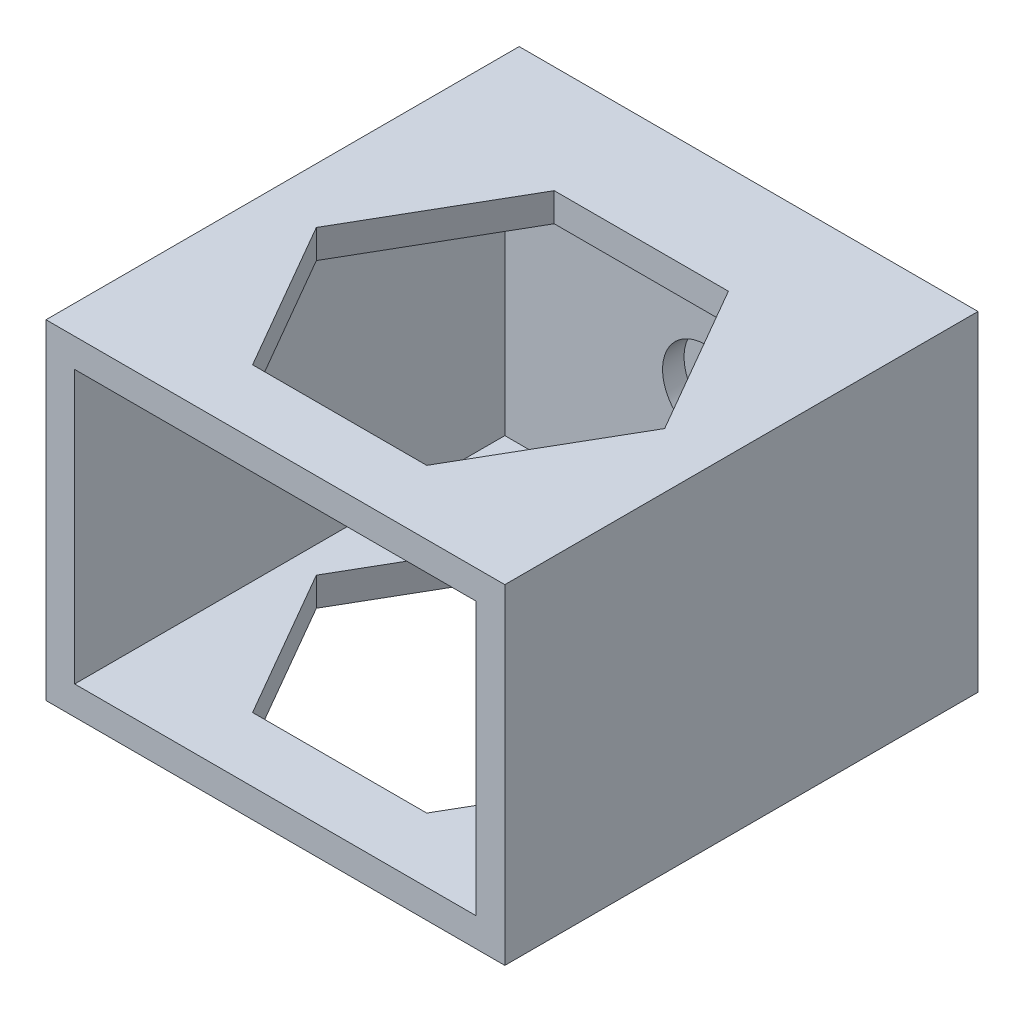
ISO-10303-21;
HEADER;
FILE_DESCRIPTION(('STEP AP214'),'2;1');
FILE_NAME('part.step','',(''),(''),'','','');
FILE_SCHEMA(('AUTOMOTIVE_DESIGN { 1 0 10303 214 1 1 1 1 }'));
ENDSEC;
DATA;
#1=APPLICATION_CONTEXT('core data for automotive mechanical design processes');
#2=APPLICATION_PROTOCOL_DEFINITION('international standard','automotive_design',2000,#1);
#3=PRODUCT_CONTEXT('',#1,'mechanical');
#4=PRODUCT('Part','Part','',(#3));
#5=PRODUCT_RELATED_PRODUCT_CATEGORY('part','',(#4));
#6=PRODUCT_DEFINITION_FORMATION('','',#4);
#7=PRODUCT_DEFINITION_CONTEXT('part definition',#1,'design');
#8=PRODUCT_DEFINITION('design','',#6,#7);
#9=PRODUCT_DEFINITION_SHAPE('','',#8);
#10=(LENGTH_UNIT() NAMED_UNIT(*) SI_UNIT(.MILLI.,.METRE.));
#11=(NAMED_UNIT(*) PLANE_ANGLE_UNIT() SI_UNIT($,.RADIAN.));
#12=(NAMED_UNIT(*) SI_UNIT($,.STERADIAN.) SOLID_ANGLE_UNIT());
#13=UNCERTAINTY_MEASURE_WITH_UNIT(LENGTH_MEASURE(1.E-05),#10,'distance_accuracy_value','');
#14=(GEOMETRIC_REPRESENTATION_CONTEXT(3) GLOBAL_UNCERTAINTY_ASSIGNED_CONTEXT((#13)) GLOBAL_UNIT_ASSIGNED_CONTEXT((#10,
#11,#12)) REPRESENTATION_CONTEXT('',''));
#15=CARTESIAN_POINT('',(0.,0.,0.));
#16=DIRECTION('',(0.,0.,1.));
#17=DIRECTION('',(1.,0.,0.));
#18=AXIS2_PLACEMENT_3D('',#15,#16,#17);
#19=CARTESIAN_POINT('',(-7.91815421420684,6.89860139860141,3.));
#20=DIRECTION('',(0.,0.,-1.));
#21=DIRECTION('',(-1.,0.,0.));
#22=AXIS2_PLACEMENT_3D('',#19,#20,#21);
#23=CYLINDRICAL_SURFACE('',#22,1.5);
#24=CARTESIAN_POINT('',(-7.91815421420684,6.89860139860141,0.));
#25=DIRECTION('',(0.,0.,1.));
#26=DIRECTION('',(1.,0.,0.));
#27=AXIS2_PLACEMENT_3D('',#24,#25,#26);
#28=CIRCLE('',#27,1.5);
#29=CARTESIAN_POINT('',(-6.41815421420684,6.89860139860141,0.));
#30=VERTEX_POINT('',#29);
#31=EDGE_CURVE('E301',#30,#30,#28,.T.);
#32=ORIENTED_EDGE('',*,*,#31,.F.);
#33=EDGE_LOOP('',(#32));
#34=FACE_BOUND('',#33,.T.);
#35=CARTESIAN_POINT('',(-7.91815421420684,6.89860139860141,1.5));
#36=DIRECTION('',(0.,0.,1.));
#37=DIRECTION('',(1.,0.,0.));
#38=AXIS2_PLACEMENT_3D('',#35,#36,#37);
#39=CIRCLE('',#38,1.5);
#40=CARTESIAN_POINT('',(-6.41815421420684,6.89860139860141,1.5));
#41=VERTEX_POINT('',#40);
#42=EDGE_CURVE('E294',#41,#41,#39,.T.);
#43=ORIENTED_EDGE('',*,*,#42,.T.);
#44=EDGE_LOOP('',(#43));
#45=FACE_BOUND('',#44,.T.);
#46=ADVANCED_FACE('F38',(#34,#45),#23,.F.);
#47=CARTESIAN_POINT('',(0.,0.,3.));
#48=DIRECTION('',(0.,0.,1.));
#49=DIRECTION('',(1.,0.,0.));
#50=AXIS2_PLACEMENT_3D('',#47,#48,#49);
#51=PLANE('',#50);
#52=DIRECTION('',(-1.,0.,0.));
#53=VECTOR('',#52,1.);
#54=CARTESIAN_POINT('',(-21.9181542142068,16.3986013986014,3.));
#55=LINE('',#54,#53);
#56=CARTESIAN_POINT('',(6.08184578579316,16.3986013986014,3.));
#57=VERTEX_POINT('',#56);
#58=CARTESIAN_POINT('',(-21.9181542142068,16.3986013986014,3.));
#59=VERTEX_POINT('',#58);
#60=EDGE_CURVE('E253',#57,#59,#55,.T.);
#61=ORIENTED_EDGE('',*,*,#60,.T.);
#62=DIRECTION('',(0.,-1.,0.));
#63=VECTOR('',#62,1.);
#64=CARTESIAN_POINT('',(-21.9181542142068,16.3986013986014,3.));
#65=LINE('',#64,#63);
#66=CARTESIAN_POINT('',(-21.9181542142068,-2.6013986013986,3.));
#67=VERTEX_POINT('',#66);
#68=EDGE_CURVE('E266',#59,#67,#65,.T.);
#69=ORIENTED_EDGE('',*,*,#68,.T.);
#70=DIRECTION('',(1.,0.,0.));
#71=VECTOR('',#70,1.);
#72=CARTESIAN_POINT('',(-21.9181542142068,-2.6013986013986,3.));
#73=LINE('',#72,#71);
#74=CARTESIAN_POINT('',(6.08184578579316,-2.6013986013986,3.));
#75=VERTEX_POINT('',#74);
#76=EDGE_CURVE('E268',#67,#75,#73,.T.);
#77=ORIENTED_EDGE('',*,*,#76,.T.);
#78=DIRECTION('',(0.,1.,0.));
#79=VECTOR('',#78,1.);
#80=CARTESIAN_POINT('',(6.08184578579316,16.3986013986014,3.));
#81=LINE('',#80,#79);
#82=EDGE_CURVE('E257',#75,#57,#81,.T.);
#83=ORIENTED_EDGE('',*,*,#82,.T.);
#84=EDGE_LOOP('',(#61,#69,#77,#83));
#85=FACE_BOUND('',#84,.T.);
#86=CARTESIAN_POINT('',(-7.91815421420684,6.89860139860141,3.));
#87=DIRECTION('',(0.,0.,1.));
#88=DIRECTION('',(1.,0.,0.));
#89=AXIS2_PLACEMENT_3D('',#86,#87,#88);
#90=CIRCLE('',#89,3.);
#91=CARTESIAN_POINT('',(-4.91815421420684,6.89860139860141,3.));
#92=VERTEX_POINT('',#91);
#93=EDGE_CURVE('E297',#92,#92,#90,.T.);
#94=ORIENTED_EDGE('',*,*,#93,.F.);
#95=EDGE_LOOP('',(#94));
#96=FACE_BOUND('',#95,.T.);
#97=ADVANCED_FACE('F364',(#85,#96),#51,.T.);
#98=CARTESIAN_POINT('',(0.,0.,0.));
#99=DIRECTION('',(0.,0.,1.));
#100=DIRECTION('',(1.,0.,0.));
#101=AXIS2_PLACEMENT_3D('',#98,#99,#100);
#102=PLANE('',#101);
#103=DIRECTION('',(0.,-1.,0.));
#104=VECTOR('',#103,1.);
#105=CARTESIAN_POINT('',(-23.9181542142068,18.3986013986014,0.));
#106=LINE('',#105,#104);
#107=CARTESIAN_POINT('',(-23.9181542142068,18.3986013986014,0.));
#108=VERTEX_POINT('',#107);
#109=CARTESIAN_POINT('',(-23.9181542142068,-4.60139860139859,0.));
#110=VERTEX_POINT('',#109);
#111=EDGE_CURVE('E306',#108,#110,#106,.T.);
#112=ORIENTED_EDGE('',*,*,#111,.F.);
#113=DIRECTION('',(-1.,0.,0.));
#114=VECTOR('',#113,1.);
#115=CARTESIAN_POINT('',(-23.9181542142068,18.3986013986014,0.));
#116=LINE('',#115,#114);
#117=CARTESIAN_POINT('',(8.08184578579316,18.3986013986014,0.));
#118=VERTEX_POINT('',#117);
#119=EDGE_CURVE('E313',#118,#108,#116,.T.);
#120=ORIENTED_EDGE('',*,*,#119,.F.);
#121=DIRECTION('',(0.,1.,0.));
#122=VECTOR('',#121,1.);
#123=CARTESIAN_POINT('',(8.08184578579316,18.3986013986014,0.));
#124=LINE('',#123,#122);
#125=CARTESIAN_POINT('',(8.08184578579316,-4.6013986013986,0.));
#126=VERTEX_POINT('',#125);
#127=EDGE_CURVE('E311',#126,#118,#124,.T.);
#128=ORIENTED_EDGE('',*,*,#127,.F.);
#129=DIRECTION('',(1.,0.,0.));
#130=VECTOR('',#129,1.);
#131=CARTESIAN_POINT('',(-23.9181542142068,-4.60139860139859,0.));
#132=LINE('',#131,#130);
#133=EDGE_CURVE('E309',#110,#126,#132,.T.);
#134=ORIENTED_EDGE('',*,*,#133,.F.);
#135=EDGE_LOOP('',(#112,#120,#128,#134));
#136=FACE_BOUND('',#135,.T.);
#137=ORIENTED_EDGE('',*,*,#31,.T.);
#138=EDGE_LOOP('',(#137));
#139=FACE_BOUND('',#138,.T.);
#140=ADVANCED_FACE('F370',(#136,#139),#102,.F.);
#141=CARTESIAN_POINT('',(-23.9181542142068,18.3986013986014,3.));
#142=DIRECTION('',(1.,0.,0.));
#143=DIRECTION('',(0.,0.,-1.));
#144=AXIS2_PLACEMENT_3D('',#141,#142,#143);
#145=PLANE('',#144);
#146=ORIENTED_EDGE('',*,*,#111,.T.);
#147=DIRECTION('',(0.,0.,-1.));
#148=VECTOR('',#147,1.);
#149=CARTESIAN_POINT('',(-23.9181542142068,-4.60139860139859,3.));
#150=LINE('',#149,#148);
#151=CARTESIAN_POINT('',(-23.9181542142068,-4.6013986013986,33.));
#152=VERTEX_POINT('',#151);
#153=EDGE_CURVE('E324',#152,#110,#150,.T.);
#154=ORIENTED_EDGE('',*,*,#153,.F.);
#155=DIRECTION('',(0.,-1.,0.));
#156=VECTOR('',#155,1.);
#157=CARTESIAN_POINT('',(-23.9181542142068,18.3986013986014,33.));
#158=LINE('',#157,#156);
#159=CARTESIAN_POINT('',(-23.9181542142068,18.3986013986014,33.));
#160=VERTEX_POINT('',#159);
#161=EDGE_CURVE('E282',#160,#152,#158,.T.);
#162=ORIENTED_EDGE('',*,*,#161,.F.);
#163=DIRECTION('',(0.,0.,-1.));
#164=VECTOR('',#163,1.);
#165=CARTESIAN_POINT('',(-23.9181542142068,18.3986013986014,3.));
#166=LINE('',#165,#164);
#167=EDGE_CURVE('E315',#160,#108,#166,.T.);
#168=ORIENTED_EDGE('',*,*,#167,.T.);
#169=EDGE_LOOP('',(#146,#154,#162,#168));
#170=FACE_BOUND('',#169,.T.);
#171=ADVANCED_FACE('F40',(#170),#145,.F.);
#172=CARTESIAN_POINT('',(-23.9181542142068,-4.60139860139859,3.));
#173=DIRECTION('',(0.,1.,0.));
#174=DIRECTION('',(-1.,0.,0.));
#175=AXIS2_PLACEMENT_3D('',#172,#173,#174);
#176=PLANE('',#175);
#177=DIRECTION('',(0.500000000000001,0.,-0.866025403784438));
#178=VECTOR('',#177,1.);
#179=CARTESIAN_POINT('',(-20.0646045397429,-4.60139860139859,18.));
#180=LINE('',#179,#178);
#181=CARTESIAN_POINT('',(-20.0646045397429,-4.60139860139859,18.));
#182=VERTEX_POINT('',#181);
#183=CARTESIAN_POINT('',(-13.9913793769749,-4.60139860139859,7.48086545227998));
#184=VERTEX_POINT('',#183);
#185=EDGE_CURVE('E189',#182,#184,#180,.T.);
#186=ORIENTED_EDGE('',*,*,#185,.F.);
#187=DIRECTION('',(-0.499999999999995,0.,-0.866025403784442));
#188=VECTOR('',#187,1.);
#189=CARTESIAN_POINT('',(-13.991379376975,-4.60139860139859,28.5191345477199));
#190=LINE('',#189,#188);
#191=CARTESIAN_POINT('',(-13.991379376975,-4.60139860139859,28.5191345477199));
#192=VERTEX_POINT('',#191);
#193=EDGE_CURVE('E53',#192,#182,#190,.T.);
#194=ORIENTED_EDGE('',*,*,#193,.F.);
#195=DIRECTION('',(-1.,0.,0.));
#196=VECTOR('',#195,1.);
#197=CARTESIAN_POINT('',(-1.8449290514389,-4.60139860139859,28.5191345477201));
#198=LINE('',#197,#196);
#199=CARTESIAN_POINT('',(-1.8449290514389,-4.60139860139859,28.5191345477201));
#200=VERTEX_POINT('',#199);
#201=EDGE_CURVE('E206',#200,#192,#198,.T.);
#202=ORIENTED_EDGE('',*,*,#201,.F.);
#203=DIRECTION('',(-0.500000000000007,0.,0.866025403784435));
#204=VECTOR('',#203,1.);
#205=CARTESIAN_POINT('',(4.22829611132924,-4.60139860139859,18.0000000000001));
#206=LINE('',#205,#204);
#207=CARTESIAN_POINT('',(4.22829611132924,-4.60139860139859,18.0000000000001));
#208=VERTEX_POINT('',#207);
#209=EDGE_CURVE('E200',#208,#200,#206,.T.);
#210=ORIENTED_EDGE('',*,*,#209,.F.);
#211=DIRECTION('',(0.499999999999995,0.,0.866025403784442));
#212=VECTOR('',#211,1.);
#213=CARTESIAN_POINT('',(-1.84492905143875,-4.60139860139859,7.48086545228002));
#214=LINE('',#213,#212);
#215=CARTESIAN_POINT('',(-1.84492905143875,-4.60139860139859,7.48086545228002));
#216=VERTEX_POINT('',#215);
#217=EDGE_CURVE('E198',#216,#208,#214,.T.);
#218=ORIENTED_EDGE('',*,*,#217,.F.);
#219=DIRECTION('',(1.,0.,0.));
#220=VECTOR('',#219,1.);
#221=CARTESIAN_POINT('',(-13.9913793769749,-4.60139860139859,7.48086545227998));
#222=LINE('',#221,#220);
#223=EDGE_CURVE('E180',#184,#216,#222,.T.);
#224=ORIENTED_EDGE('',*,*,#223,.F.);
#225=EDGE_LOOP('',(#186,#194,#202,#210,#218,#224));
#226=FACE_BOUND('',#225,.T.);
#227=ORIENTED_EDGE('',*,*,#133,.T.);
#228=DIRECTION('',(0.,0.,-1.));
#229=VECTOR('',#228,1.);
#230=CARTESIAN_POINT('',(8.08184578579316,-4.6013986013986,3.));
#231=LINE('',#230,#229);
#232=CARTESIAN_POINT('',(8.08184578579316,-4.6013986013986,33.));
#233=VERTEX_POINT('',#232);
#234=EDGE_CURVE('E321',#233,#126,#231,.T.);
#235=ORIENTED_EDGE('',*,*,#234,.F.);
#236=DIRECTION('',(1.,0.,0.));
#237=VECTOR('',#236,1.);
#238=CARTESIAN_POINT('',(-23.9181542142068,-4.6013986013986,33.));
#239=LINE('',#238,#237);
#240=EDGE_CURVE('E285',#152,#233,#239,.T.);
#241=ORIENTED_EDGE('',*,*,#240,.F.);
#242=ORIENTED_EDGE('',*,*,#153,.T.);
#243=EDGE_LOOP('',(#227,#235,#241,#242));
#244=FACE_BOUND('',#243,.T.);
#245=ADVANCED_FACE('F194',(#226,#244),#176,.F.);
#246=CARTESIAN_POINT('',(8.08184578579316,18.3986013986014,3.));
#247=DIRECTION('',(-1.,0.,0.));
#248=DIRECTION('',(0.,0.,1.));
#249=AXIS2_PLACEMENT_3D('',#246,#247,#248);
#250=PLANE('',#249);
#251=ORIENTED_EDGE('',*,*,#127,.T.);
#252=DIRECTION('',(0.,0.,-1.));
#253=VECTOR('',#252,1.);
#254=CARTESIAN_POINT('',(8.08184578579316,18.3986013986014,3.));
#255=LINE('',#254,#253);
#256=CARTESIAN_POINT('',(8.08184578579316,18.3986013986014,33.));
#257=VERTEX_POINT('',#256);
#258=EDGE_CURVE('E318',#257,#118,#255,.T.);
#259=ORIENTED_EDGE('',*,*,#258,.F.);
#260=DIRECTION('',(0.,1.,0.));
#261=VECTOR('',#260,1.);
#262=CARTESIAN_POINT('',(8.08184578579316,18.3986013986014,33.));
#263=LINE('',#262,#261);
#264=EDGE_CURVE('E288',#233,#257,#263,.T.);
#265=ORIENTED_EDGE('',*,*,#264,.F.);
#266=ORIENTED_EDGE('',*,*,#234,.T.);
#267=EDGE_LOOP('',(#251,#259,#265,#266));
#268=FACE_BOUND('',#267,.T.);
#269=ADVANCED_FACE('F385',(#268),#250,.F.);
#270=CARTESIAN_POINT('',(-23.9181542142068,18.3986013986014,3.));
#271=DIRECTION('',(0.,-1.,0.));
#272=DIRECTION('',(0.,0.,-1.));
#273=AXIS2_PLACEMENT_3D('',#270,#271,#272);
#274=PLANE('',#273);
#275=DIRECTION('',(-1.,0.,0.));
#276=VECTOR('',#275,1.);
#277=CARTESIAN_POINT('',(-23.9181542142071,18.3986013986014,28.5191345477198));
#278=LINE('',#277,#276);
#279=CARTESIAN_POINT('',(-1.8449290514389,18.3986013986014,28.5191345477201));
#280=VERTEX_POINT('',#279);
#281=CARTESIAN_POINT('',(-13.991379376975,18.3986013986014,28.5191345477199));
#282=VERTEX_POINT('',#281);
#283=EDGE_CURVE('E244',#280,#282,#278,.T.);
#284=ORIENTED_EDGE('',*,*,#283,.T.);
#285=DIRECTION('',(-0.499999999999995,0.,-0.866025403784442));
#286=VECTOR('',#285,1.);
#287=CARTESIAN_POINT('',(-27.5231824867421,18.3986013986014,5.08136404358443));
#288=LINE('',#287,#286);
#289=CARTESIAN_POINT('',(-20.0646045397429,18.3986013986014,18.));
#290=VERTEX_POINT('',#289);
#291=EDGE_CURVE('E250',#282,#290,#288,.T.);
#292=ORIENTED_EDGE('',*,*,#291,.T.);
#293=DIRECTION('',(0.500000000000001,0.,-0.866025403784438));
#294=VECTOR('',#293,1.);
#295=CARTESIAN_POINT('',(-14.5328014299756,18.3986013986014,8.41863595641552));
#296=LINE('',#295,#294);
#297=CARTESIAN_POINT('',(-13.9913793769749,18.3986013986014,7.48086545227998));
#298=VERTEX_POINT('',#297);
#299=EDGE_CURVE('E224',#290,#298,#296,.T.);
#300=ORIENTED_EDGE('',*,*,#299,.T.);
#301=DIRECTION('',(1.,0.,0.));
#302=VECTOR('',#301,1.);
#303=CARTESIAN_POINT('',(-23.9181542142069,18.3986013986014,7.48086545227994));
#304=LINE('',#303,#302);
#305=CARTESIAN_POINT('',(-1.84492905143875,18.3986013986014,7.48086545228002));
#306=VERTEX_POINT('',#305);
#307=EDGE_CURVE('E229',#298,#306,#304,.T.);
#308=ORIENTED_EDGE('',*,*,#307,.T.);
#309=DIRECTION('',(0.499999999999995,0.,0.866025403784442));
#310=VECTOR('',#309,1.);
#311=CARTESIAN_POINT('',(-9.30350699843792,18.3986013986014,-5.43777050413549));
#312=LINE('',#311,#310);
#313=CARTESIAN_POINT('',(4.22829611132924,18.3986013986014,18.0000000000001));
#314=VERTEX_POINT('',#313);
#315=EDGE_CURVE('E234',#306,#314,#312,.T.);
#316=ORIENTED_EDGE('',*,*,#315,.T.);
#317=DIRECTION('',(-0.500000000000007,0.,0.866025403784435));
#318=VECTOR('',#317,1.);
#319=CARTESIAN_POINT('',(3.68687405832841,18.3986013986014,18.9377705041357));
#320=LINE('',#319,#318);
#321=EDGE_CURVE('E239',#314,#280,#320,.T.);
#322=ORIENTED_EDGE('',*,*,#321,.T.);
#323=EDGE_LOOP('',(#284,#292,#300,#308,#316,#322));
#324=FACE_BOUND('',#323,.T.);
#325=ORIENTED_EDGE('',*,*,#119,.T.);
#326=ORIENTED_EDGE('',*,*,#167,.F.);
#327=DIRECTION('',(-1.,0.,0.));
#328=VECTOR('',#327,1.);
#329=CARTESIAN_POINT('',(-23.9181542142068,18.3986013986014,33.));
#330=LINE('',#329,#328);
#331=EDGE_CURVE('E291',#257,#160,#330,.T.);
#332=ORIENTED_EDGE('',*,*,#331,.F.);
#333=ORIENTED_EDGE('',*,*,#258,.T.);
#334=EDGE_LOOP('',(#325,#326,#332,#333));
#335=FACE_BOUND('',#334,.T.);
#336=ADVANCED_FACE('F382',(#324,#335),#274,.F.);
#337=CARTESIAN_POINT('',(-7.91815421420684,6.89860139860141,1.5));
#338=DIRECTION('',(0.,0.,1.));
#339=DIRECTION('',(1.,0.,0.));
#340=AXIS2_PLACEMENT_3D('',#337,#338,#339);
#341=CYLINDRICAL_SURFACE('',#340,3.);
#342=CARTESIAN_POINT('',(-7.91815421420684,6.89860139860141,1.5));
#343=DIRECTION('',(0.,0.,1.));
#344=DIRECTION('',(1.,0.,0.));
#345=AXIS2_PLACEMENT_3D('',#342,#343,#344);
#346=CIRCLE('',#345,3.);
#347=CARTESIAN_POINT('',(-4.91815421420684,6.89860139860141,1.5));
#348=VERTEX_POINT('',#347);
#349=EDGE_CURVE('E298',#348,#348,#346,.T.);
#350=ORIENTED_EDGE('',*,*,#349,.F.);
#351=EDGE_LOOP('',(#350));
#352=FACE_BOUND('',#351,.T.);
#353=ORIENTED_EDGE('',*,*,#93,.T.);
#354=EDGE_LOOP('',(#353));
#355=FACE_BOUND('',#354,.T.);
#356=ADVANCED_FACE('F376',(#352,#355),#341,.F.);
#357=CARTESIAN_POINT('',(-7.91815421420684,6.89860139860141,1.5));
#358=DIRECTION('',(0.,0.,1.));
#359=DIRECTION('',(1.,0.,0.));
#360=AXIS2_PLACEMENT_3D('',#357,#358,#359);
#361=PLANE('',#360);
#362=ORIENTED_EDGE('',*,*,#42,.F.);
#363=EDGE_LOOP('',(#362));
#364=FACE_BOUND('',#363,.T.);
#365=ORIENTED_EDGE('',*,*,#349,.T.);
#366=EDGE_LOOP('',(#365));
#367=FACE_BOUND('',#366,.T.);
#368=ADVANCED_FACE('F410',(#364,#367),#361,.T.);
#369=CARTESIAN_POINT('',(0.,0.,33.));
#370=DIRECTION('',(0.,0.,1.));
#371=DIRECTION('',(1.,0.,0.));
#372=AXIS2_PLACEMENT_3D('',#369,#370,#371);
#373=PLANE('',#372);
#374=ORIENTED_EDGE('',*,*,#161,.T.);
#375=ORIENTED_EDGE('',*,*,#240,.T.);
#376=ORIENTED_EDGE('',*,*,#264,.T.);
#377=ORIENTED_EDGE('',*,*,#331,.T.);
#378=EDGE_LOOP('',(#374,#375,#376,#377));
#379=FACE_BOUND('',#378,.T.);
#380=DIRECTION('',(0.,-1.,0.));
#381=VECTOR('',#380,1.);
#382=CARTESIAN_POINT('',(-21.9181542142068,16.3986013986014,33.));
#383=LINE('',#382,#381);
#384=CARTESIAN_POINT('',(-21.9181542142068,16.3986013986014,33.));
#385=VERTEX_POINT('',#384);
#386=CARTESIAN_POINT('',(-21.9181542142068,-2.6013986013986,33.));
#387=VERTEX_POINT('',#386);
#388=EDGE_CURVE('E256',#385,#387,#383,.T.);
#389=ORIENTED_EDGE('',*,*,#388,.F.);
#390=DIRECTION('',(-1.,0.,0.));
#391=VECTOR('',#390,1.);
#392=CARTESIAN_POINT('',(-21.9181542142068,16.3986013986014,33.));
#393=LINE('',#392,#391);
#394=CARTESIAN_POINT('',(6.08184578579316,16.3986013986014,33.));
#395=VERTEX_POINT('',#394);
#396=EDGE_CURVE('E254',#395,#385,#393,.T.);
#397=ORIENTED_EDGE('',*,*,#396,.F.);
#398=DIRECTION('',(0.,1.,0.));
#399=VECTOR('',#398,1.);
#400=CARTESIAN_POINT('',(6.08184578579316,16.3986013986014,33.));
#401=LINE('',#400,#399);
#402=CARTESIAN_POINT('',(6.08184578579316,-2.6013986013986,33.));
#403=VERTEX_POINT('',#402);
#404=EDGE_CURVE('E262',#403,#395,#401,.T.);
#405=ORIENTED_EDGE('',*,*,#404,.F.);
#406=DIRECTION('',(1.,0.,0.));
#407=VECTOR('',#406,1.);
#408=CARTESIAN_POINT('',(-21.9181542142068,-2.6013986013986,33.));
#409=LINE('',#408,#407);
#410=EDGE_CURVE('E259',#387,#403,#409,.T.);
#411=ORIENTED_EDGE('',*,*,#410,.F.);
#412=EDGE_LOOP('',(#389,#397,#405,#411));
#413=FACE_BOUND('',#412,.T.);
#414=ADVANCED_FACE('F404',(#379,#413),#373,.T.);
#415=CARTESIAN_POINT('',(-21.9181542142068,16.3986013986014,33.));
#416=DIRECTION('',(0.,-1.,0.));
#417=DIRECTION('',(0.,0.,-1.));
#418=AXIS2_PLACEMENT_3D('',#415,#416,#417);
#419=PLANE('',#418);
#420=DIRECTION('',(-0.499999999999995,0.,-0.866025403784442));
#421=VECTOR('',#420,1.);
#422=CARTESIAN_POINT('',(-14.0328014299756,16.3986013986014,28.447389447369));
#423=LINE('',#422,#421);
#424=CARTESIAN_POINT('',(-13.991379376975,16.3986013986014,28.5191345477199));
#425=VERTEX_POINT('',#424);
#426=CARTESIAN_POINT('',(-20.0646045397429,16.3986013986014,18.));
#427=VERTEX_POINT('',#426);
#428=EDGE_CURVE('E247',#425,#427,#423,.T.);
#429=ORIENTED_EDGE('',*,*,#428,.F.);
#430=DIRECTION('',(-1.,0.,0.));
#431=VECTOR('',#430,1.);
#432=CARTESIAN_POINT('',(-21.9181542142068,16.3986013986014,28.5191345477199));
#433=LINE('',#432,#431);
#434=CARTESIAN_POINT('',(-1.8449290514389,16.3986013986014,28.5191345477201));
#435=VERTEX_POINT('',#434);
#436=EDGE_CURVE('E242',#435,#425,#433,.T.);
#437=ORIENTED_EDGE('',*,*,#436,.F.);
#438=DIRECTION('',(-0.500000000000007,0.,0.866025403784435));
#439=VECTOR('',#438,1.);
#440=CARTESIAN_POINT('',(-8.80350699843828,16.3986013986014,40.5717451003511));
#441=LINE('',#440,#439);
#442=CARTESIAN_POINT('',(4.22829611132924,16.3986013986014,18.0000000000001));
#443=VERTEX_POINT('',#442);
#444=EDGE_CURVE('E237',#443,#435,#441,.T.);
#445=ORIENTED_EDGE('',*,*,#444,.F.);
#446=DIRECTION('',(0.499999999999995,0.,0.866025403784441));
#447=VECTOR('',#446,1.);
#448=CARTESIAN_POINT('',(4.18687405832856,16.3986013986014,17.9282548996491));
#449=LINE('',#448,#447);
#450=CARTESIAN_POINT('',(-1.84492905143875,16.3986013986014,7.48086545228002));
#451=VERTEX_POINT('',#450);
#452=EDGE_CURVE('E232',#451,#443,#449,.T.);
#453=ORIENTED_EDGE('',*,*,#452,.F.);
#454=DIRECTION('',(1.,0.,0.));
#455=VECTOR('',#454,1.);
#456=CARTESIAN_POINT('',(-21.9181542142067,16.3986013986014,7.48086545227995));
#457=LINE('',#456,#455);
#458=CARTESIAN_POINT('',(-13.9913793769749,16.3986013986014,7.48086545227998));
#459=VERTEX_POINT('',#458);
#460=EDGE_CURVE('E227',#459,#451,#457,.T.);
#461=ORIENTED_EDGE('',*,*,#460,.F.);
#462=DIRECTION('',(0.500000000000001,0.,-0.866025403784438));
#463=VECTOR('',#462,1.);
#464=CARTESIAN_POINT('',(-27.0231824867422,16.3986013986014,30.0526105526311));
#465=LINE('',#464,#463);
#466=EDGE_CURVE('E222',#427,#459,#465,.T.);
#467=ORIENTED_EDGE('',*,*,#466,.F.);
#468=EDGE_LOOP('',(#429,#437,#445,#453,#461,#467));
#469=FACE_BOUND('',#468,.T.);
#470=ORIENTED_EDGE('',*,*,#60,.F.);
#471=DIRECTION('',(0.,0.,-1.));
#472=VECTOR('',#471,1.);
#473=CARTESIAN_POINT('',(6.08184578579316,16.3986013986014,33.));
#474=LINE('',#473,#472);
#475=EDGE_CURVE('E264',#395,#57,#474,.T.);
#476=ORIENTED_EDGE('',*,*,#475,.F.);
#477=ORIENTED_EDGE('',*,*,#396,.T.);
#478=DIRECTION('',(0.,0.,-1.));
#479=VECTOR('',#478,1.);
#480=CARTESIAN_POINT('',(-21.9181542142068,16.3986013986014,33.));
#481=LINE('',#480,#479);
#482=EDGE_CURVE('E279',#385,#59,#481,.T.);
#483=ORIENTED_EDGE('',*,*,#482,.T.);
#484=EDGE_LOOP('',(#470,#476,#477,#483));
#485=FACE_BOUND('',#484,.T.);
#486=ADVANCED_FACE('F409',(#469,#485),#419,.T.);
#487=CARTESIAN_POINT('',(-21.9181542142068,16.3986013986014,33.));
#488=DIRECTION('',(1.,0.,0.));
#489=DIRECTION('',(0.,0.,-1.));
#490=AXIS2_PLACEMENT_3D('',#487,#488,#489);
#491=PLANE('',#490);
#492=ORIENTED_EDGE('',*,*,#68,.F.);
#493=ORIENTED_EDGE('',*,*,#482,.F.);
#494=ORIENTED_EDGE('',*,*,#388,.T.);
#495=DIRECTION('',(0.,0.,-1.));
#496=VECTOR('',#495,1.);
#497=CARTESIAN_POINT('',(-21.9181542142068,-2.6013986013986,33.));
#498=LINE('',#497,#496);
#499=EDGE_CURVE('E276',#387,#67,#498,.T.);
#500=ORIENTED_EDGE('',*,*,#499,.T.);
#501=EDGE_LOOP('',(#492,#493,#494,#500));
#502=FACE_BOUND('',#501,.T.);
#503=ADVANCED_FACE('F420',(#502),#491,.T.);
#504=CARTESIAN_POINT('',(-21.9181542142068,-2.6013986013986,33.));
#505=DIRECTION('',(0.,1.,0.));
#506=DIRECTION('',(0.,0.,1.));
#507=AXIS2_PLACEMENT_3D('',#504,#505,#506);
#508=PLANE('',#507);
#509=DIRECTION('',(0.499999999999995,0.,0.866025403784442));
#510=VECTOR('',#509,1.);
#511=CARTESIAN_POINT('',(-14.0328014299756,-2.6013986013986,28.447389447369));
#512=LINE('',#511,#510);
#513=CARTESIAN_POINT('',(-20.0646045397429,-2.6013986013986,18.));
#514=VERTEX_POINT('',#513);
#515=CARTESIAN_POINT('',(-13.991379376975,-2.6013986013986,28.5191345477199));
#516=VERTEX_POINT('',#515);
#517=EDGE_CURVE('E12',#514,#516,#512,.T.);
#518=ORIENTED_EDGE('',*,*,#517,.F.);
#519=DIRECTION('',(-0.500000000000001,0.,0.866025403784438));
#520=VECTOR('',#519,1.);
#521=CARTESIAN_POINT('',(-27.0231824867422,-2.6013986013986,30.0526105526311));
#522=LINE('',#521,#520);
#523=CARTESIAN_POINT('',(-13.9913793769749,-2.6013986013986,7.48086545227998));
#524=VERTEX_POINT('',#523);
#525=EDGE_CURVE('E327',#524,#514,#522,.T.);
#526=ORIENTED_EDGE('',*,*,#525,.F.);
#527=DIRECTION('',(-1.,0.,0.));
#528=VECTOR('',#527,1.);
#529=CARTESIAN_POINT('',(-21.9181542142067,-2.6013986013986,7.48086545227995));
#530=LINE('',#529,#528);
#531=CARTESIAN_POINT('',(-1.84492905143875,-2.6013986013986,7.48086545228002));
#532=VERTEX_POINT('',#531);
#533=EDGE_CURVE('E183',#532,#524,#530,.T.);
#534=ORIENTED_EDGE('',*,*,#533,.F.);
#535=DIRECTION('',(-0.499999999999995,0.,-0.866025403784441));
#536=VECTOR('',#535,1.);
#537=CARTESIAN_POINT('',(4.18687405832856,-2.6013986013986,17.9282548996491));
#538=LINE('',#537,#536);
#539=CARTESIAN_POINT('',(4.22829611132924,-2.6013986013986,18.0000000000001));
#540=VERTEX_POINT('',#539);
#541=EDGE_CURVE('E330',#540,#532,#538,.T.);
#542=ORIENTED_EDGE('',*,*,#541,.F.);
#543=DIRECTION('',(0.500000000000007,0.,-0.866025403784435));
#544=VECTOR('',#543,1.);
#545=CARTESIAN_POINT('',(-8.80350699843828,-2.6013986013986,40.5717451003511));
#546=LINE('',#545,#544);
#547=CARTESIAN_POINT('',(-1.8449290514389,-2.6013986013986,28.5191345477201));
#548=VERTEX_POINT('',#547);
#549=EDGE_CURVE('E332',#548,#540,#546,.T.);
#550=ORIENTED_EDGE('',*,*,#549,.F.);
#551=DIRECTION('',(1.,0.,0.));
#552=VECTOR('',#551,1.);
#553=CARTESIAN_POINT('',(-21.9181542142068,-2.6013986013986,28.5191345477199));
#554=LINE('',#553,#552);
#555=EDGE_CURVE('E46',#516,#548,#554,.T.);
#556=ORIENTED_EDGE('',*,*,#555,.F.);
#557=EDGE_LOOP('',(#518,#526,#534,#542,#550,#556));
#558=FACE_BOUND('',#557,.T.);
#559=ORIENTED_EDGE('',*,*,#76,.F.);
#560=ORIENTED_EDGE('',*,*,#499,.F.);
#561=ORIENTED_EDGE('',*,*,#410,.T.);
#562=DIRECTION('',(0.,0.,-1.));
#563=VECTOR('',#562,1.);
#564=CARTESIAN_POINT('',(6.08184578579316,-2.6013986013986,33.));
#565=LINE('',#564,#563);
#566=EDGE_CURVE('E273',#403,#75,#565,.T.);
#567=ORIENTED_EDGE('',*,*,#566,.T.);
#568=EDGE_LOOP('',(#559,#560,#561,#567));
#569=FACE_BOUND('',#568,.T.);
#570=ADVANCED_FACE('F346',(#558,#569),#508,.T.);
#571=CARTESIAN_POINT('',(6.08184578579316,16.3986013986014,33.));
#572=DIRECTION('',(-1.,0.,0.));
#573=DIRECTION('',(0.,-1.,0.));
#574=AXIS2_PLACEMENT_3D('',#571,#572,#573);
#575=PLANE('',#574);
#576=ORIENTED_EDGE('',*,*,#82,.F.);
#577=ORIENTED_EDGE('',*,*,#566,.F.);
#578=ORIENTED_EDGE('',*,*,#404,.T.);
#579=ORIENTED_EDGE('',*,*,#475,.T.);
#580=EDGE_LOOP('',(#576,#577,#578,#579));
#581=FACE_BOUND('',#580,.T.);
#582=ADVANCED_FACE('F428',(#581),#575,.T.);
#583=CARTESIAN_POINT('',(-20.0646045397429,25.3986013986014,18.));
#584=DIRECTION('',(-0.866025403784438,0.,-0.500000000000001));
#585=DIRECTION('',(-0.500000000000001,0.,0.866025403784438));
#586=AXIS2_PLACEMENT_3D('',#583,#584,#585);
#587=PLANE('',#586);
#588=ORIENTED_EDGE('',*,*,#525,.T.);
#589=DIRECTION('',(0.,-1.,0.));
#590=VECTOR('',#589,1.);
#591=CARTESIAN_POINT('',(-20.0646045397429,25.3986013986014,18.));
#592=LINE('',#591,#590);
#593=EDGE_CURVE('E191',#514,#182,#592,.T.);
#594=ORIENTED_EDGE('',*,*,#593,.T.);
#595=ORIENTED_EDGE('',*,*,#185,.T.);
#596=DIRECTION('',(0.,-1.,0.));
#597=VECTOR('',#596,1.);
#598=CARTESIAN_POINT('',(-13.9913793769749,25.3986013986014,7.48086545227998));
#599=LINE('',#598,#597);
#600=EDGE_CURVE('E175',#524,#184,#599,.T.);
#601=ORIENTED_EDGE('',*,*,#600,.F.);
#602=EDGE_LOOP('',(#588,#594,#595,#601));
#603=FACE_BOUND('',#602,.T.);
#604=ADVANCED_FACE('F190',(#603),#587,.F.);
#605=CARTESIAN_POINT('',(-13.9913793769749,25.3986013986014,7.48086545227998));
#606=DIRECTION('',(0.,0.,-1.));
#607=DIRECTION('',(-1.,0.,0.));
#608=AXIS2_PLACEMENT_3D('',#605,#606,#607);
#609=PLANE('',#608);
#610=ORIENTED_EDGE('',*,*,#533,.T.);
#611=ORIENTED_EDGE('',*,*,#600,.T.);
#612=ORIENTED_EDGE('',*,*,#223,.T.);
#613=DIRECTION('',(0.,-1.,0.));
#614=VECTOR('',#613,1.);
#615=CARTESIAN_POINT('',(-1.84492905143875,25.3986013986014,7.48086545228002));
#616=LINE('',#615,#614);
#617=EDGE_CURVE('E219',#532,#216,#616,.T.);
#618=ORIENTED_EDGE('',*,*,#617,.F.);
#619=EDGE_LOOP('',(#610,#611,#612,#618));
#620=FACE_BOUND('',#619,.T.);
#621=ADVANCED_FACE('F177',(#620),#609,.F.);
#622=CARTESIAN_POINT('',(-1.84492905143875,25.3986013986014,7.48086545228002));
#623=DIRECTION('',(0.866025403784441,0.,-0.499999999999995));
#624=DIRECTION('',(-0.499999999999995,0.,-0.866025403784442));
#625=AXIS2_PLACEMENT_3D('',#622,#623,#624);
#626=PLANE('',#625);
#627=ORIENTED_EDGE('',*,*,#541,.T.);
#628=ORIENTED_EDGE('',*,*,#617,.T.);
#629=ORIENTED_EDGE('',*,*,#217,.T.);
#630=DIRECTION('',(0.,-1.,0.));
#631=VECTOR('',#630,1.);
#632=CARTESIAN_POINT('',(4.22829611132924,25.3986013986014,18.0000000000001));
#633=LINE('',#632,#631);
#634=EDGE_CURVE('E216',#540,#208,#633,.T.);
#635=ORIENTED_EDGE('',*,*,#634,.F.);
#636=EDGE_LOOP('',(#627,#628,#629,#635));
#637=FACE_BOUND('',#636,.T.);
#638=ADVANCED_FACE('F349',(#637),#626,.F.);
#639=CARTESIAN_POINT('',(4.22829611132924,25.3986013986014,18.0000000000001));
#640=DIRECTION('',(0.866025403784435,0.,0.500000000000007));
#641=DIRECTION('',(0.500000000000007,0.,-0.866025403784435));
#642=AXIS2_PLACEMENT_3D('',#639,#640,#641);
#643=PLANE('',#642);
#644=ORIENTED_EDGE('',*,*,#549,.T.);
#645=ORIENTED_EDGE('',*,*,#634,.T.);
#646=ORIENTED_EDGE('',*,*,#209,.T.);
#647=DIRECTION('',(0.,-1.,0.));
#648=VECTOR('',#647,1.);
#649=CARTESIAN_POINT('',(-1.8449290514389,25.3986013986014,28.5191345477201));
#650=LINE('',#649,#648);
#651=EDGE_CURVE('E213',#548,#200,#650,.T.);
#652=ORIENTED_EDGE('',*,*,#651,.F.);
#653=EDGE_LOOP('',(#644,#645,#646,#652));
#654=FACE_BOUND('',#653,.T.);
#655=ADVANCED_FACE('F342',(#654),#643,.F.);
#656=CARTESIAN_POINT('',(-1.8449290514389,25.3986013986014,28.5191345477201));
#657=DIRECTION('',(0.,0.,1.));
#658=DIRECTION('',(1.,0.,0.));
#659=AXIS2_PLACEMENT_3D('',#656,#657,#658);
#660=PLANE('',#659);
#661=ORIENTED_EDGE('',*,*,#555,.T.);
#662=ORIENTED_EDGE('',*,*,#651,.T.);
#663=ORIENTED_EDGE('',*,*,#201,.T.);
#664=DIRECTION('',(0.,-1.,0.));
#665=VECTOR('',#664,1.);
#666=CARTESIAN_POINT('',(-13.991379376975,25.3986013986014,28.5191345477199));
#667=LINE('',#666,#665);
#668=EDGE_CURVE('E209',#516,#192,#667,.T.);
#669=ORIENTED_EDGE('',*,*,#668,.F.);
#670=EDGE_LOOP('',(#661,#662,#663,#669));
#671=FACE_BOUND('',#670,.T.);
#672=ADVANCED_FACE('F337',(#671),#660,.F.);
#673=CARTESIAN_POINT('',(-13.991379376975,25.3986013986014,28.5191345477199));
#674=DIRECTION('',(-0.866025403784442,0.,0.499999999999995));
#675=DIRECTION('',(0.499999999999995,0.,0.866025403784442));
#676=AXIS2_PLACEMENT_3D('',#673,#674,#675);
#677=PLANE('',#676);
#678=ORIENTED_EDGE('',*,*,#517,.T.);
#679=ORIENTED_EDGE('',*,*,#668,.T.);
#680=ORIENTED_EDGE('',*,*,#193,.T.);
#681=ORIENTED_EDGE('',*,*,#593,.F.);
#682=EDGE_LOOP('',(#678,#679,#680,#681));
#683=FACE_BOUND('',#682,.T.);
#684=ADVANCED_FACE('F439',(#683),#677,.F.);
#685=EDGE_CURVE('E211',#282,#425,#667,.T.);
#686=ORIENTED_EDGE('',*,*,#685,.T.);
#687=ORIENTED_EDGE('',*,*,#428,.T.);
#688=EDGE_CURVE('E186',#290,#427,#592,.T.);
#689=ORIENTED_EDGE('',*,*,#688,.F.);
#690=ORIENTED_EDGE('',*,*,#291,.F.);
#691=EDGE_LOOP('',(#686,#687,#689,#690));
#692=FACE_BOUND('',#691,.T.);
#693=ADVANCED_FACE('F569',(#692),#677,.F.);
#694=EDGE_CURVE('E212',#280,#435,#650,.T.);
#695=ORIENTED_EDGE('',*,*,#694,.T.);
#696=ORIENTED_EDGE('',*,*,#436,.T.);
#697=ORIENTED_EDGE('',*,*,#685,.F.);
#698=ORIENTED_EDGE('',*,*,#283,.F.);
#699=EDGE_LOOP('',(#695,#696,#697,#698));
#700=FACE_BOUND('',#699,.T.);
#701=ADVANCED_FACE('F562',(#700),#660,.F.);
#702=EDGE_CURVE('E215',#314,#443,#633,.T.);
#703=ORIENTED_EDGE('',*,*,#702,.T.);
#704=ORIENTED_EDGE('',*,*,#444,.T.);
#705=ORIENTED_EDGE('',*,*,#694,.F.);
#706=ORIENTED_EDGE('',*,*,#321,.F.);
#707=EDGE_LOOP('',(#703,#704,#705,#706));
#708=FACE_BOUND('',#707,.T.);
#709=ADVANCED_FACE('F358',(#708),#643,.F.);
#710=EDGE_CURVE('E218',#306,#451,#616,.T.);
#711=ORIENTED_EDGE('',*,*,#710,.T.);
#712=ORIENTED_EDGE('',*,*,#452,.T.);
#713=ORIENTED_EDGE('',*,*,#702,.F.);
#714=ORIENTED_EDGE('',*,*,#315,.F.);
#715=EDGE_LOOP('',(#711,#712,#713,#714));
#716=FACE_BOUND('',#715,.T.);
#717=ADVANCED_FACE('F352',(#716),#626,.F.);
#718=EDGE_CURVE('E61',#298,#459,#599,.T.);
#719=ORIENTED_EDGE('',*,*,#718,.T.);
#720=ORIENTED_EDGE('',*,*,#460,.T.);
#721=ORIENTED_EDGE('',*,*,#710,.F.);
#722=ORIENTED_EDGE('',*,*,#307,.F.);
#723=EDGE_LOOP('',(#719,#720,#721,#722));
#724=FACE_BOUND('',#723,.T.);
#725=ADVANCED_FACE('F360',(#724),#609,.F.);
#726=ORIENTED_EDGE('',*,*,#688,.T.);
#727=ORIENTED_EDGE('',*,*,#466,.T.);
#728=ORIENTED_EDGE('',*,*,#718,.F.);
#729=ORIENTED_EDGE('',*,*,#299,.F.);
#730=EDGE_LOOP('',(#726,#727,#728,#729));
#731=FACE_BOUND('',#730,.T.);
#732=ADVANCED_FACE('F436',(#731),#587,.F.);
#733=CLOSED_SHELL('',(#46,#97,#140,#171,#245,#269,#336,#356,#368,#414,#486,#503,#570,#582,#604,
#621,#638,#655,#672,#684,#693,#701,#709,#717,#725,#732));
#734=MANIFOLD_SOLID_BREP('B2',#733);
#735=ADVANCED_BREP_SHAPE_REPRESENTATION('',(#18,#734),#14);
#736=SHAPE_DEFINITION_REPRESENTATION(#9,#735);
ENDSEC;
END-ISO-10303-21;
